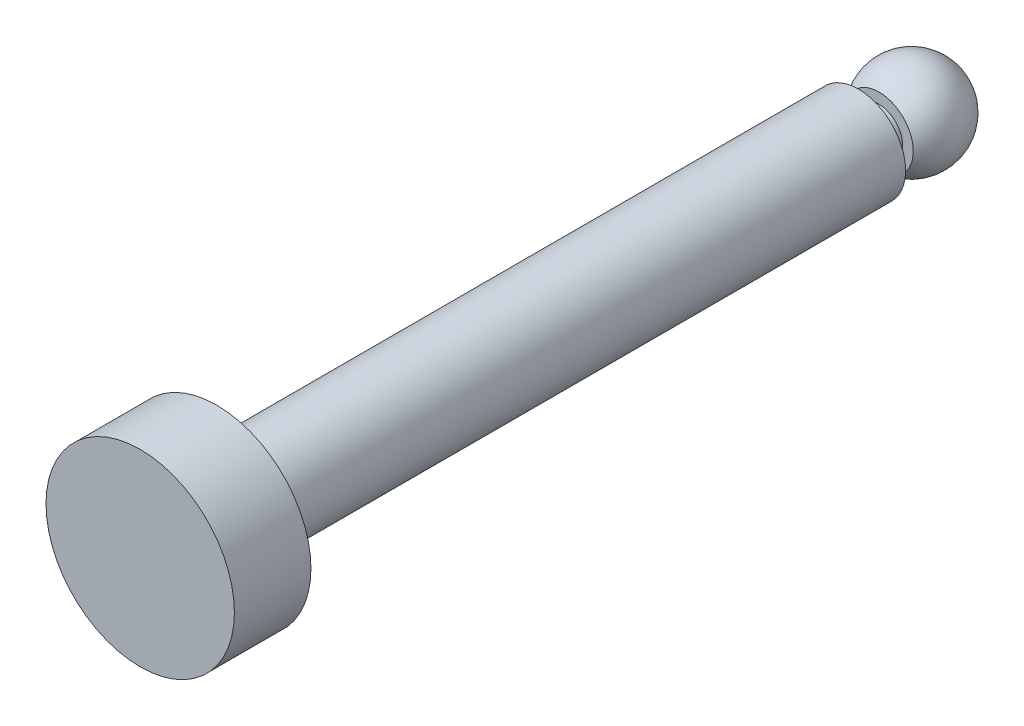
ISO-10303-21;
HEADER;
FILE_DESCRIPTION(('STEP AP214'),'2;1');
FILE_NAME('part.step','',(''),(''),'','','');
FILE_SCHEMA(('AUTOMOTIVE_DESIGN { 1 0 10303 214 1 1 1 1 }'));
ENDSEC;
DATA;
#1=APPLICATION_CONTEXT('core data for automotive mechanical design processes');
#2=APPLICATION_PROTOCOL_DEFINITION('international standard','automotive_design',2000,#1);
#3=PRODUCT_CONTEXT('',#1,'mechanical');
#4=PRODUCT('Part','Part','',(#3));
#5=PRODUCT_RELATED_PRODUCT_CATEGORY('part','',(#4));
#6=PRODUCT_DEFINITION_FORMATION('','',#4);
#7=PRODUCT_DEFINITION_CONTEXT('part definition',#1,'design');
#8=PRODUCT_DEFINITION('design','',#6,#7);
#9=PRODUCT_DEFINITION_SHAPE('','',#8);
#10=(LENGTH_UNIT() NAMED_UNIT(*) SI_UNIT(.MILLI.,.METRE.));
#11=(NAMED_UNIT(*) PLANE_ANGLE_UNIT() SI_UNIT($,.RADIAN.));
#12=(NAMED_UNIT(*) SI_UNIT($,.STERADIAN.) SOLID_ANGLE_UNIT());
#13=UNCERTAINTY_MEASURE_WITH_UNIT(LENGTH_MEASURE(1.E-05),#10,'distance_accuracy_value','');
#14=(GEOMETRIC_REPRESENTATION_CONTEXT(3) GLOBAL_UNCERTAINTY_ASSIGNED_CONTEXT((#13)) GLOBAL_UNIT_ASSIGNED_CONTEXT((#10,
#11,#12)) REPRESENTATION_CONTEXT('',''));
#15=CARTESIAN_POINT('',(0.,0.,0.));
#16=DIRECTION('',(0.,0.,1.));
#17=DIRECTION('',(1.,0.,0.));
#18=AXIS2_PLACEMENT_3D('',#15,#16,#17);
#19=CARTESIAN_POINT('',(0.,-16.,139.));
#20=DIRECTION('',(0.,0.,-1.));
#21=DIRECTION('',(0.,-1.,0.));
#22=AXIS2_PLACEMENT_3D('',#19,#20,#21);
#23=PLANE('',#22);
#24=CARTESIAN_POINT('',(0.,0.,139.));
#25=DIRECTION('',(0.,0.,1.));
#26=DIRECTION('',(0.,1.,0.));
#27=AXIS2_PLACEMENT_3D('',#24,#25,#26);
#28=CIRCLE('',#27,16.);
#29=CARTESIAN_POINT('',(0.,16.,139.));
#30=VERTEX_POINT('',#29);
#31=EDGE_CURVE('E37',#30,#30,#28,.T.);
#32=ORIENTED_EDGE('',*,*,#31,.T.);
#33=EDGE_LOOP('',(#32));
#34=FACE_BOUND('',#33,.T.);
#35=ADVANCED_FACE('F12',(#34),#23,.F.);
#36=CARTESIAN_POINT('',(0.,0.,8.));
#37=DIRECTION('',(0.,-1.,0.));
#38=DIRECTION('',(-1.,0.,0.));
#39=AXIS2_PLACEMENT_3D('',#36,#37,#38);
#40=SPHERICAL_SURFACE('',#39,8.);
#41=CARTESIAN_POINT('',(0.,0.,8.));
#42=DIRECTION('',(0.,0.,1.));
#43=DIRECTION('',(0.,1.,0.));
#44=AXIS2_PLACEMENT_3D('',#41,#42,#43);
#45=SPHERICAL_SURFACE('',#44,8.);
#46=CARTESIAN_POINT('',(0.,0.,13.5));
#47=DIRECTION('',(0.,0.,1.));
#48=DIRECTION('',(0.,1.,0.));
#49=AXIS2_PLACEMENT_3D('',#46,#47,#48);
#50=CIRCLE('',#49,5.80947501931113);
#51=CARTESIAN_POINT('',(0.,5.80947501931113,13.5));
#52=VERTEX_POINT('',#51);
#53=EDGE_CURVE('E8',#52,#52,#50,.T.);
#54=ORIENTED_EDGE('',*,*,#53,.F.);
#55=EDGE_LOOP('',(#54));
#56=FACE_BOUND('',#55,.T.);
#57=ADVANCED_FACE('F67',(#56),#45,.T.);
#58=CARTESIAN_POINT('',(0.,-5.80947501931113,13.5));
#59=DIRECTION('',(0.,0.,-1.));
#60=DIRECTION('',(0.,-1.,0.));
#61=AXIS2_PLACEMENT_3D('',#58,#59,#60);
#62=PLANE('',#61);
#63=CARTESIAN_POINT('',(0.,0.,13.5));
#64=DIRECTION('',(0.,0.,1.));
#65=DIRECTION('',(0.,1.,0.));
#66=AXIS2_PLACEMENT_3D('',#63,#64,#65);
#67=CIRCLE('',#66,4.);
#68=CARTESIAN_POINT('',(0.,4.,13.5));
#69=VERTEX_POINT('',#68);
#70=EDGE_CURVE('E18',#69,#69,#67,.T.);
#71=ORIENTED_EDGE('',*,*,#70,.F.);
#72=EDGE_LOOP('',(#71));
#73=FACE_BOUND('',#72,.T.);
#74=ORIENTED_EDGE('',*,*,#53,.T.);
#75=EDGE_LOOP('',(#74));
#76=FACE_BOUND('',#75,.T.);
#77=ADVANCED_FACE('F71',(#73,#76),#62,.F.);
#78=CARTESIAN_POINT('',(0.,0.,8.3));
#79=DIRECTION('',(0.,0.,1.));
#80=DIRECTION('',(0.,1.,0.));
#81=AXIS2_PLACEMENT_3D('',#78,#79,#80);
#82=CYLINDRICAL_SURFACE('',#81,4.);
#83=ORIENTED_EDGE('',*,*,#70,.T.);
#84=EDGE_LOOP('',(#83));
#85=FACE_BOUND('',#84,.T.);
#86=CARTESIAN_POINT('',(0.,0.,17.));
#87=DIRECTION('',(0.,0.,1.));
#88=DIRECTION('',(0.,1.,0.));
#89=AXIS2_PLACEMENT_3D('',#86,#87,#88);
#90=CIRCLE('',#89,4.);
#91=CARTESIAN_POINT('',(0.,4.,17.));
#92=VERTEX_POINT('',#91);
#93=EDGE_CURVE('E22',#92,#92,#90,.T.);
#94=ORIENTED_EDGE('',*,*,#93,.F.);
#95=EDGE_LOOP('',(#94));
#96=FACE_BOUND('',#95,.T.);
#97=ADVANCED_FACE('F63',(#85,#96),#82,.T.);
#98=CARTESIAN_POINT('',(0.,-8.,17.));
#99=DIRECTION('',(0.,0.,-1.));
#100=DIRECTION('',(0.,-1.,0.));
#101=AXIS2_PLACEMENT_3D('',#98,#99,#100);
#102=PLANE('',#101);
#103=ORIENTED_EDGE('',*,*,#93,.T.);
#104=EDGE_LOOP('',(#103));
#105=FACE_BOUND('',#104,.T.);
#106=CARTESIAN_POINT('',(0.,0.,17.));
#107=DIRECTION('',(0.,0.,1.));
#108=DIRECTION('',(0.,1.,0.));
#109=AXIS2_PLACEMENT_3D('',#106,#107,#108);
#110=CIRCLE('',#109,8.);
#111=CARTESIAN_POINT('',(0.,8.,17.));
#112=VERTEX_POINT('',#111);
#113=EDGE_CURVE('E26',#112,#112,#110,.T.);
#114=ORIENTED_EDGE('',*,*,#113,.F.);
#115=EDGE_LOOP('',(#114));
#116=FACE_BOUND('',#115,.T.);
#117=ADVANCED_FACE('F56',(#105,#116),#102,.T.);
#118=CARTESIAN_POINT('',(0.,0.,8.3));
#119=DIRECTION('',(0.,0.,1.));
#120=DIRECTION('',(0.,1.,0.));
#121=AXIS2_PLACEMENT_3D('',#118,#119,#120);
#122=CYLINDRICAL_SURFACE('',#121,8.);
#123=ORIENTED_EDGE('',*,*,#113,.T.);
#124=EDGE_LOOP('',(#123));
#125=FACE_BOUND('',#124,.T.);
#126=CARTESIAN_POINT('',(0.,0.,126.));
#127=DIRECTION('',(0.,0.,1.));
#128=DIRECTION('',(0.,1.,0.));
#129=AXIS2_PLACEMENT_3D('',#126,#127,#128);
#130=CIRCLE('',#129,8.);
#131=CARTESIAN_POINT('',(0.,8.,126.));
#132=VERTEX_POINT('',#131);
#133=EDGE_CURVE('E31',#132,#132,#130,.T.);
#134=ORIENTED_EDGE('',*,*,#133,.F.);
#135=EDGE_LOOP('',(#134));
#136=FACE_BOUND('',#135,.T.);
#137=ADVANCED_FACE('F51',(#125,#136),#122,.T.);
#138=CARTESIAN_POINT('',(0.,-8.,126.));
#139=DIRECTION('',(0.,0.,1.));
#140=DIRECTION('',(0.,1.,0.));
#141=AXIS2_PLACEMENT_3D('',#138,#139,#140);
#142=PLANE('',#141);
#143=CARTESIAN_POINT('',(0.,0.,126.));
#144=DIRECTION('',(0.,0.,1.));
#145=DIRECTION('',(0.,1.,0.));
#146=AXIS2_PLACEMENT_3D('',#143,#144,#145);
#147=CIRCLE('',#146,16.);
#148=CARTESIAN_POINT('',(0.,16.,126.));
#149=VERTEX_POINT('',#148);
#150=EDGE_CURVE('E34',#149,#149,#147,.T.);
#151=ORIENTED_EDGE('',*,*,#150,.F.);
#152=EDGE_LOOP('',(#151));
#153=FACE_BOUND('',#152,.T.);
#154=ORIENTED_EDGE('',*,*,#133,.T.);
#155=EDGE_LOOP('',(#154));
#156=FACE_BOUND('',#155,.T.);
#157=ADVANCED_FACE('F45',(#153,#156),#142,.F.);
#158=CARTESIAN_POINT('',(0.,0.,8.3));
#159=DIRECTION('',(0.,0.,1.));
#160=DIRECTION('',(0.,1.,0.));
#161=AXIS2_PLACEMENT_3D('',#158,#159,#160);
#162=CYLINDRICAL_SURFACE('',#161,16.);
#163=ORIENTED_EDGE('',*,*,#31,.F.);
#164=EDGE_LOOP('',(#163));
#165=FACE_BOUND('',#164,.T.);
#166=ORIENTED_EDGE('',*,*,#150,.T.);
#167=EDGE_LOOP('',(#166));
#168=FACE_BOUND('',#167,.T.);
#169=ADVANCED_FACE('F42',(#165,#168),#162,.T.);
#170=CLOSED_SHELL('',(#35,#57,#77,#97,#117,#137,#157,#169));
#171=MANIFOLD_SOLID_BREP('B1',#170);
#172=ADVANCED_BREP_SHAPE_REPRESENTATION('',(#18,#171),#14);
#173=SHAPE_DEFINITION_REPRESENTATION(#9,#172);
ENDSEC;
END-ISO-10303-21;
